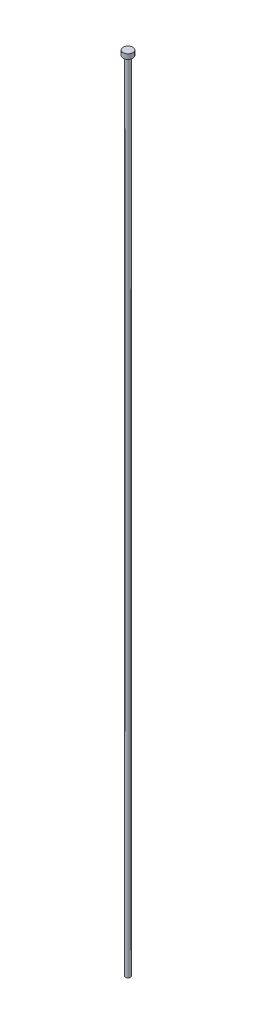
ISO-10303-21;
HEADER;
FILE_DESCRIPTION(('STEP AP214'),'2;1');
FILE_NAME('part.step','',(''),(''),'','','');
FILE_SCHEMA(('AUTOMOTIVE_DESIGN { 1 0 10303 214 1 1 1 1 }'));
ENDSEC;
DATA;
#1=APPLICATION_CONTEXT('core data for automotive mechanical design processes');
#2=APPLICATION_PROTOCOL_DEFINITION('international standard','automotive_design',2000,#1);
#3=PRODUCT_CONTEXT('',#1,'mechanical');
#4=PRODUCT('Part','Part','',(#3));
#5=PRODUCT_RELATED_PRODUCT_CATEGORY('part','',(#4));
#6=PRODUCT_DEFINITION_FORMATION('','',#4);
#7=PRODUCT_DEFINITION_CONTEXT('part definition',#1,'design');
#8=PRODUCT_DEFINITION('design','',#6,#7);
#9=PRODUCT_DEFINITION_SHAPE('','',#8);
#10=(LENGTH_UNIT() NAMED_UNIT(*) SI_UNIT(.MILLI.,.METRE.));
#11=(NAMED_UNIT(*) PLANE_ANGLE_UNIT() SI_UNIT($,.RADIAN.));
#12=(NAMED_UNIT(*) SI_UNIT($,.STERADIAN.) SOLID_ANGLE_UNIT());
#13=UNCERTAINTY_MEASURE_WITH_UNIT(LENGTH_MEASURE(1.E-05),#10,'distance_accuracy_value','');
#14=(GEOMETRIC_REPRESENTATION_CONTEXT(3) GLOBAL_UNCERTAINTY_ASSIGNED_CONTEXT((#13)) GLOBAL_UNIT_ASSIGNED_CONTEXT((#10,
#11,#12)) REPRESENTATION_CONTEXT('',''));
#15=CARTESIAN_POINT('',(0.,0.,0.));
#16=DIRECTION('',(0.,0.,1.));
#17=DIRECTION('',(1.,0.,0.));
#18=AXIS2_PLACEMENT_3D('',#15,#16,#17);
#19=CARTESIAN_POINT('',(0.,-500.,0.));
#20=DIRECTION('',(0.,1.,0.));
#21=DIRECTION('',(0.,0.,1.));
#22=AXIS2_PLACEMENT_3D('',#19,#20,#21);
#23=CYLINDRICAL_SURFACE('',#22,1.5);
#24=CARTESIAN_POINT('',(0.,-3.30000000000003,0.));
#25=DIRECTION('',(0.,1.,0.));
#26=DIRECTION('',(0.,0.,1.));
#27=AXIS2_PLACEMENT_3D('',#24,#25,#26);
#28=CIRCLE('',#27,1.5);
#29=CARTESIAN_POINT('',(0.,-3.30000000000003,1.5));
#30=VERTEX_POINT('',#29);
#31=EDGE_CURVE('E35',#30,#30,#28,.F.);
#32=ORIENTED_EDGE('',*,*,#31,.T.);
#33=EDGE_LOOP('',(#32));
#34=FACE_BOUND('',#33,.T.);
#35=CARTESIAN_POINT('',(0.,-500.,0.));
#36=DIRECTION('',(0.,1.,0.));
#37=DIRECTION('',(0.,0.,1.));
#38=AXIS2_PLACEMENT_3D('',#35,#36,#37);
#39=CIRCLE('',#38,1.5);
#40=CARTESIAN_POINT('',(0.,-500.,1.5));
#41=VERTEX_POINT('',#40);
#42=EDGE_CURVE('E39',#41,#41,#39,.T.);
#43=ORIENTED_EDGE('',*,*,#42,.T.);
#44=EDGE_LOOP('',(#43));
#45=FACE_BOUND('',#44,.T.);
#46=ADVANCED_FACE('F28',(#34,#45),#23,.T.);
#47=CARTESIAN_POINT('',(0.,-500.,0.));
#48=DIRECTION('',(0.,1.,0.));
#49=DIRECTION('',(0.,0.,1.));
#50=AXIS2_PLACEMENT_3D('',#47,#48,#49);
#51=PLANE('',#50);
#52=ORIENTED_EDGE('',*,*,#42,.F.);
#53=EDGE_LOOP('',(#52));
#54=FACE_BOUND('',#53,.T.);
#55=ADVANCED_FACE('F65',(#54),#51,.F.);
#56=CARTESIAN_POINT('',(0.,-3.,0.));
#57=DIRECTION('',(0.,1.,0.));
#58=DIRECTION('',(0.,0.,1.));
#59=AXIS2_PLACEMENT_3D('',#56,#57,#58);
#60=CYLINDRICAL_SURFACE('',#59,3.);
#61=CARTESIAN_POINT('',(0.,-3.,0.));
#62=DIRECTION('',(0.,1.,0.));
#63=DIRECTION('',(0.,0.,1.));
#64=AXIS2_PLACEMENT_3D('',#61,#62,#63);
#65=CIRCLE('',#64,3.);
#66=CARTESIAN_POINT('',(0.,-3.,3.));
#67=VERTEX_POINT('',#66);
#68=EDGE_CURVE('E43',#67,#67,#65,.T.);
#69=ORIENTED_EDGE('',*,*,#68,.T.);
#70=EDGE_LOOP('',(#69));
#71=FACE_BOUND('',#70,.T.);
#72=CARTESIAN_POINT('',(0.,0.,0.));
#73=DIRECTION('',(0.,1.,0.));
#74=DIRECTION('',(0.,0.,1.));
#75=AXIS2_PLACEMENT_3D('',#72,#73,#74);
#76=CIRCLE('',#75,3.);
#77=CARTESIAN_POINT('',(0.,0.,3.));
#78=VERTEX_POINT('',#77);
#79=EDGE_CURVE('E46',#78,#78,#76,.T.);
#80=ORIENTED_EDGE('',*,*,#79,.F.);
#81=EDGE_LOOP('',(#80));
#82=FACE_BOUND('',#81,.T.);
#83=ADVANCED_FACE('F52',(#71,#82),#60,.T.);
#84=CARTESIAN_POINT('',(0.,-3.,0.));
#85=DIRECTION('',(0.,1.,0.));
#86=DIRECTION('',(0.,0.,1.));
#87=AXIS2_PLACEMENT_3D('',#84,#85,#86);
#88=PLANE('',#87);
#89=CARTESIAN_POINT('',(0.,-3.,0.));
#90=DIRECTION('',(0.,1.,0.));
#91=DIRECTION('',(0.,0.,1.));
#92=AXIS2_PLACEMENT_3D('',#89,#90,#91);
#93=CIRCLE('',#92,1.8);
#94=CARTESIAN_POINT('',(0.,-3.,1.8));
#95=VERTEX_POINT('',#94);
#96=EDGE_CURVE('E10',#95,#95,#93,.T.);
#97=ORIENTED_EDGE('',*,*,#96,.T.);
#98=EDGE_LOOP('',(#97));
#99=FACE_BOUND('',#98,.T.);
#100=ORIENTED_EDGE('',*,*,#68,.F.);
#101=EDGE_LOOP('',(#100));
#102=FACE_BOUND('',#101,.T.);
#103=ADVANCED_FACE('F55',(#99,#102),#88,.F.);
#104=CARTESIAN_POINT('',(0.,0.,0.));
#105=DIRECTION('',(0.,1.,0.));
#106=DIRECTION('',(0.,0.,1.));
#107=AXIS2_PLACEMENT_3D('',#104,#105,#106);
#108=PLANE('',#107);
#109=ORIENTED_EDGE('',*,*,#79,.T.);
#110=EDGE_LOOP('',(#109));
#111=FACE_BOUND('',#110,.T.);
#112=ADVANCED_FACE('F57',(#111),#108,.T.);
#113=CARTESIAN_POINT('',(0.,-3.30000000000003,0.));
#114=DIRECTION('',(0.,1.,0.));
#115=DIRECTION('',(0.,0.,1.));
#116=AXIS2_PLACEMENT_3D('',#113,#114,#115);
#117=TOROIDAL_SURFACE('',#116,1.8,0.3);
#118=ORIENTED_EDGE('',*,*,#96,.F.);
#119=EDGE_LOOP('',(#118));
#120=FACE_BOUND('',#119,.T.);
#121=ORIENTED_EDGE('',*,*,#31,.F.);
#122=EDGE_LOOP('',(#121));
#123=FACE_BOUND('',#122,.T.);
#124=ADVANCED_FACE('F30',(#120,#123),#117,.F.);
#125=CLOSED_SHELL('',(#46,#55,#83,#103,#112,#124));
#126=MANIFOLD_SOLID_BREP('B2',#125);
#127=ADVANCED_BREP_SHAPE_REPRESENTATION('',(#18,#126),#14);
#128=SHAPE_DEFINITION_REPRESENTATION(#9,#127);
ENDSEC;
END-ISO-10303-21;
